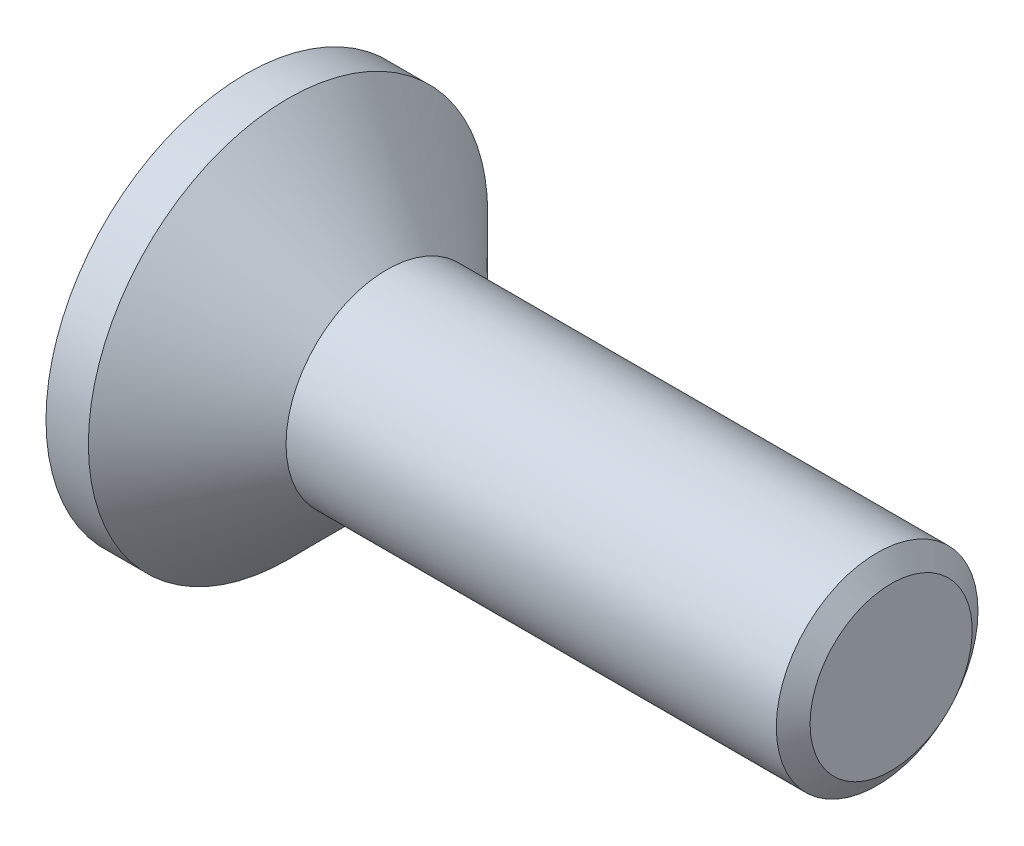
from build123d import *

# Parameters (mm, degrees)
ENL_V_MAT_EXTRU_1_DEPTH = 1.75
ESQUISSE4_R             = 0.753333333
EXTRUSION1_DEPTH        = 1.75


with BuildPart() as part:
    # Esquisse1 → R_volution1 (revolve)
    with BuildSketch(Plane(origin=(0, 0, 0), x_dir=(1, 0, 0), z_dir=(0, 1, 0)), mode=Mode.PRIVATE) as r_volution1_sk:
        Polygon((0.5, 0), (0.5, 1.666666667), (0, 1.666666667), (0, 4.95), (1.05, 4.95), (3.5, 2.5), (15.653164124, 2.5), (16, 2.0095), (16, 0), align=None)
    revolve(r_volution1_sk.sketch.rotate(Axis((16, 0, 0), (-1, 0, 0)), 180), axis=Axis((16, 0, 0), (-1, 0, 0)))

    # Esquisse2 → Enl_vement de mati_re-R_volution1 (revolve, cut)
    with BuildSketch(Plane.XY, mode=Mode.PRIVATE) as enl_vement_de_mati_re_r_volution1_sk:
        Polygon((-0.1, 0), (-0.1, 2.35), (0.045, 2.35), (0.674680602, 0), align=None)
    revolve(enl_vement_de_mati_re_r_volution1_sk.sketch.rotate(Axis((0.674680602, 0, 0), (-1, 0, 0)), 180), axis=Axis((0.674680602, 0, 0), (-1, 0, 0)), mode=Mode.SUBTRACT)

    # Esquisse3 → Enl_v. mat.-Extru.1 (cut)
    with BuildSketch(Plane(origin=(0, 0, 0), x_dir=(0, 0, -1), z_dir=(1, 0, 0))):
        with BuildLine():
            ThreePointArc((-1.912303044, 0.439800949), (-2.26, 0), (-1.912303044, -0.439800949))
            ThreePointArc((-1.912303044, -0.439800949), (-1.409807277, -0.813952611), (-1.337030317, -1.436202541))
            ThreePointArc((-1.337030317, -1.436202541), (-1.13, -1.957217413), (-0.575272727, -1.87600349))
            ThreePointArc((-0.575272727, -1.87600349), (0, -1.627905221), (0.575272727, -1.87600349))
            ThreePointArc((0.575272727, -1.87600349), (1.129999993, -1.957217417), (1.337030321, -1.436202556))
            ThreePointArc((1.337030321, -1.436202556), (1.409807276, -0.813952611), (1.912303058, -0.439800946))
            ThreePointArc((1.912303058, -0.439800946), (2.26, 7e-09), (1.912303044, 0.439800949))
            ThreePointArc((1.912303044, 0.439800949), (1.409807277, 0.813952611), (1.337030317, 1.436202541))
            ThreePointArc((1.337030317, 1.436202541), (1.13, 1.957217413), (0.575272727, 1.87600349))
            ThreePointArc((0.575272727, 1.87600349), (0, 1.627905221), (-0.575272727, 1.87600349))
            ThreePointArc((-0.575272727, 1.87600349), (-1.13, 1.957217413), (-1.337030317, 1.436202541))
            ThreePointArc((-1.337030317, 1.436202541), (-1.409807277, 0.813952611), (-1.912303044, 0.439800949))
        make_face()
    extrude(amount=ENL_V_MAT_EXTRU_1_DEPTH, mode=Mode.SUBTRACT)

    # Esquisse4 → Extrusion1 (add)
    with BuildSketch(Plane.ZY.offset(-0.5)):
        Circle(ESQUISSE4_R)
    extrude(amount=-EXTRUSION1_DEPTH)


solid = part.part
